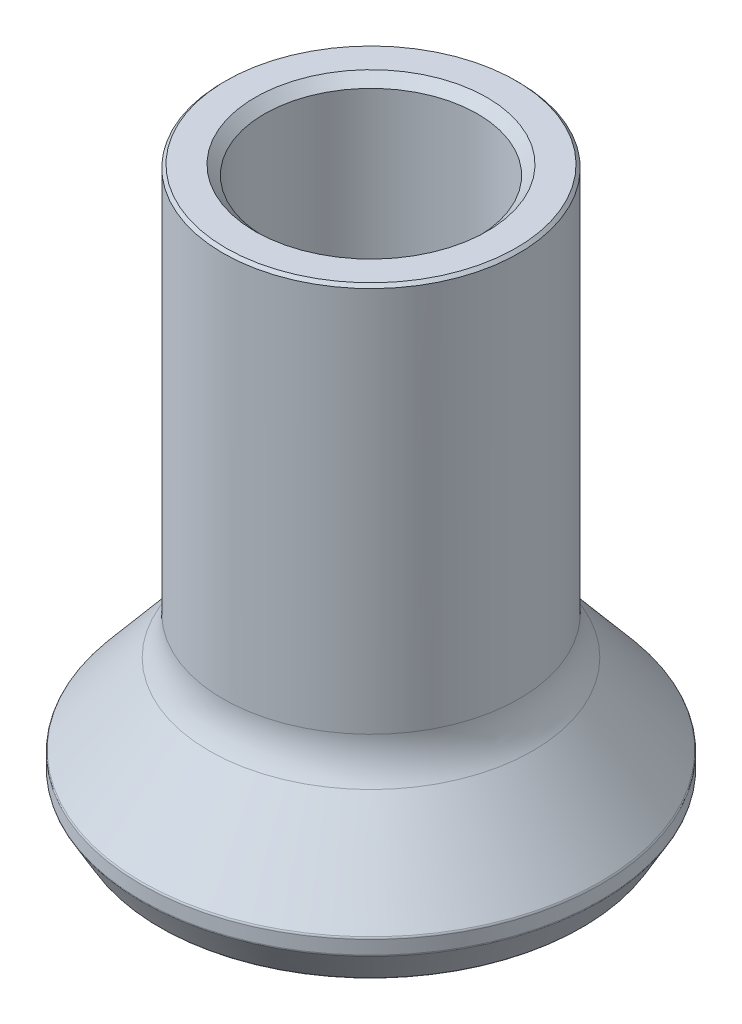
from build123d import *

# Parameters (mm, degrees)
CHAMFER_1_SIZE = 0.8
CHAMFER_2_SIZE = 0.5
FILLET_2_R     = 0.25
CHAMFER_3_SIZE = 0.25


with BuildPart() as part:
    # Sketch 1 → Revolve 1 (revolve)
    with BuildSketch(Plane.XY, mode=Mode.PRIVATE) as revolve_1_sk:
        with BuildLine():
            Line((17.783419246, 0), (19.4, 2.8))
            Line((19.4, 2.8), (19.4, 4.1))
            Line((19.4, 4.1), (13.669777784, 10.929012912))
            ThreePointArc((13.669777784, 10.929012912), (12.801536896, 12.432850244), (12.5, 14.14295096))
            Line((12.5, 14.14295096), (12.5, 47))
            Line((12.5, 47), (9, 47))
            Line((9, 47), (9, 19.9))
            Line((9, 19.9), (4.4, 19.9))
            Line((4.4, 19.9), (4.4, 10.8))
            Line((4.4, 10.8), (7.05, 10.8))
            Line((7.05, 10.8), (7.05, 2.8))
            Line((7.05, 2.8), (15.9, 2.8))
            Line((15.9, 2.8), (17.205661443, 0))
            Line((17.205661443, 0), (17.783419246, 0))
        make_face()
    revolve(revolve_1_sk.sketch.rotate(Axis((0, 0, 0), (0, 1, 0)), 90), axis=Axis((0, 0, 0), (0, 1, 0)))

    # Chamfer 1
    chamfer_1_edges = [part.edges().sort_by_distance(p)[0] for p in [
        (0, 47, 9),
    ]]
    chamfer(chamfer_1_edges, length=CHAMFER_1_SIZE)

    # Chamfer 2
    chamfer_2_edges = [part.edges().sort_by_distance(p)[0] for p in [
        (0, 10.8, 4.4),
        (0, 2.8, 7.05),
    ]]
    chamfer(chamfer_2_edges, length=CHAMFER_2_SIZE)

    # Fillet 2
    fillet_2_edges = [part.edges().sort_by_distance(p)[0] for p in [
        (0, 0, 17.783419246),
        (0, 2.8, 19.4),
        (0, 4.1, 19.4),
        (0, 2.8, 15.9),
        (0, 0, 17.205661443),
    ]]
    fillet(fillet_2_edges, radius=FILLET_2_R)

    # Chamfer 3
    chamfer_3_edges = [part.edges().sort_by_distance(p)[0] for p in [
        (0, 47, 12.5),
    ]]
    chamfer(chamfer_3_edges, length=CHAMFER_3_SIZE)


solid = part.part
